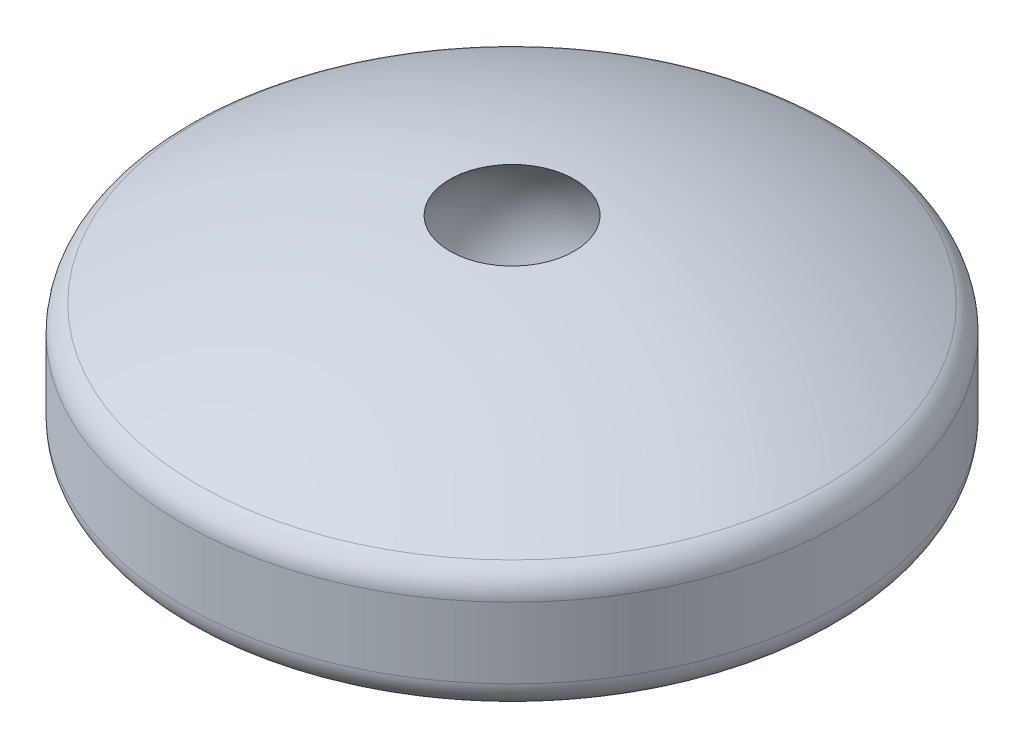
from build123d import *


with BuildPart() as part:
    # Sketch1 → Revolve1 (revolve)
    with BuildSketch(Plane.XY, mode=Mode.PRIVATE) as revolve1_sk:
        with BuildLine():
            Line((0, 0), (-20.5, 0))
            ThreePointArc((-20.5, 0), (-21.914213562, 0.585786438), (-22.5, 2))
            Line((-22.5, 2), (-22.5, 6.824473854))
            ThreePointArc((-22.5, 6.824473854), (-22.217366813, 7.849486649), (-21.44934877, 8.584796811))
            ThreePointArc((-21.44934877, 8.584796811), (-11.061181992, 12.625288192), (0, 14))
            Line((0, 14), (0, 0))
        make_face()
    revolve(revolve1_sk.sketch.rotate(Axis((0, 0, 0), (0, -1, 0)), 270), axis=Axis((0, 0, 0), (0, -1, 0)))

    # Sketch2 → Cut-Revolve1 (revolve, cut)
    with BuildSketch(Plane(origin=(0, 0, 0), x_dir=(0, 0, -1), z_dir=(1, 0, 0))):
        with BuildLine():
            Line((0, 15.381615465), (0, 2.381615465))
            ThreePointArc((0, 2.381615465), (6.5, 8.881615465), (0, 15.381615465))
        make_face()
    revolve(axis=Axis((0, 15.381615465, 0), (0, 1, 0)), mode=Mode.SUBTRACT)


solid = part.part
